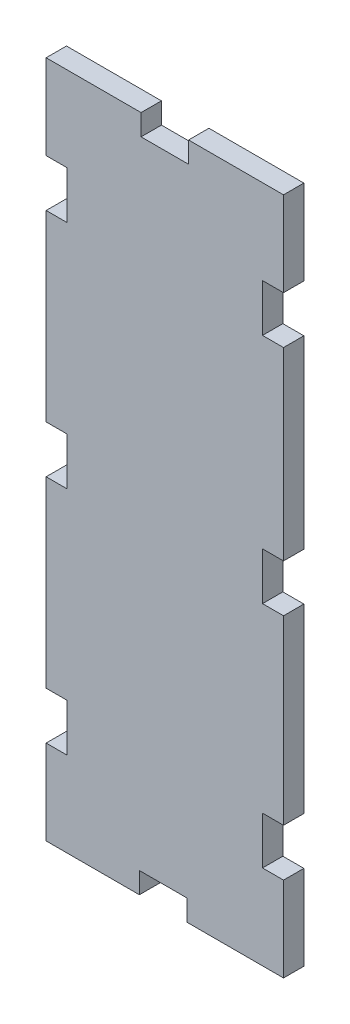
ISO-10303-21;
HEADER;
FILE_DESCRIPTION(('STEP AP214'),'2;1');
FILE_NAME('part.step','',(''),(''),'','','');
FILE_SCHEMA(('AUTOMOTIVE_DESIGN { 1 0 10303 214 1 1 1 1 }'));
ENDSEC;
DATA;
#1=APPLICATION_CONTEXT('core data for automotive mechanical design processes');
#2=APPLICATION_PROTOCOL_DEFINITION('international standard','automotive_design',2000,#1);
#3=PRODUCT_CONTEXT('',#1,'mechanical');
#4=PRODUCT('Part','Part','',(#3));
#5=PRODUCT_RELATED_PRODUCT_CATEGORY('part','',(#4));
#6=PRODUCT_DEFINITION_FORMATION('','',#4);
#7=PRODUCT_DEFINITION_CONTEXT('part definition',#1,'design');
#8=PRODUCT_DEFINITION('design','',#6,#7);
#9=PRODUCT_DEFINITION_SHAPE('','',#8);
#10=(LENGTH_UNIT() NAMED_UNIT(*) SI_UNIT(.MILLI.,.METRE.));
#11=(NAMED_UNIT(*) PLANE_ANGLE_UNIT() SI_UNIT($,.RADIAN.));
#12=(NAMED_UNIT(*) SI_UNIT($,.STERADIAN.) SOLID_ANGLE_UNIT());
#13=UNCERTAINTY_MEASURE_WITH_UNIT(LENGTH_MEASURE(1.E-05),#10,'distance_accuracy_value','');
#14=(GEOMETRIC_REPRESENTATION_CONTEXT(3) GLOBAL_UNCERTAINTY_ASSIGNED_CONTEXT((#13)) GLOBAL_UNIT_ASSIGNED_CONTEXT((#10,
#11,#12)) REPRESENTATION_CONTEXT('',''));
#15=CARTESIAN_POINT('',(0.,0.,0.));
#16=DIRECTION('',(0.,0.,1.));
#17=DIRECTION('',(1.,0.,0.));
#18=AXIS2_PLACEMENT_3D('',#15,#16,#17);
#19=CARTESIAN_POINT('',(0.,0.,6.));
#20=DIRECTION('',(1.,0.,0.));
#21=DIRECTION('',(0.,0.,-1.));
#22=AXIS2_PLACEMENT_3D('',#19,#20,#21);
#23=PLANE('',#22);
#24=DIRECTION('',(0.,-1.,0.));
#25=VECTOR('',#24,1.);
#26=CARTESIAN_POINT('',(0.,0.,6.));
#27=LINE('',#26,#25);
#28=CARTESIAN_POINT('',(0.,25.,6.));
#29=VERTEX_POINT('',#28);
#30=CARTESIAN_POINT('',(0.,0.,6.));
#31=VERTEX_POINT('',#30);
#32=EDGE_CURVE('E490',#29,#31,#27,.T.);
#33=ORIENTED_EDGE('',*,*,#32,.F.);
#34=DIRECTION('',(0.,0.,1.));
#35=VECTOR('',#34,1.);
#36=CARTESIAN_POINT('',(0.,25.,0.));
#37=LINE('',#36,#35);
#38=CARTESIAN_POINT('',(0.,25.,0.));
#39=VERTEX_POINT('',#38);
#40=EDGE_CURVE('E321',#39,#29,#37,.T.);
#41=ORIENTED_EDGE('',*,*,#40,.F.);
#42=DIRECTION('',(0.,-1.,0.));
#43=VECTOR('',#42,1.);
#44=CARTESIAN_POINT('',(0.,0.,0.));
#45=LINE('',#44,#43);
#46=CARTESIAN_POINT('',(0.,0.,0.));
#47=VERTEX_POINT('',#46);
#48=EDGE_CURVE('E301',#39,#47,#45,.T.);
#49=ORIENTED_EDGE('',*,*,#48,.T.);
#50=DIRECTION('',(0.,0.,-1.));
#51=VECTOR('',#50,1.);
#52=CARTESIAN_POINT('',(0.,0.,6.));
#53=LINE('',#52,#51);
#54=EDGE_CURVE('E11',#31,#47,#53,.T.);
#55=ORIENTED_EDGE('',*,*,#54,.F.);
#56=EDGE_LOOP('',(#33,#41,#49,#55));
#57=FACE_BOUND('',#56,.T.);
#58=ADVANCED_FACE('F36',(#57),#23,.F.);
#59=CARTESIAN_POINT('',(0.,93.,0.));
#60=VERTEX_POINT('',#59);
#61=CARTESIAN_POINT('',(0.,39.,0.));
#62=VERTEX_POINT('',#61);
#63=EDGE_CURVE('E591',#60,#62,#45,.T.);
#64=ORIENTED_EDGE('',*,*,#63,.T.);
#65=DIRECTION('',(0.,0.,1.));
#66=VECTOR('',#65,1.);
#67=CARTESIAN_POINT('',(0.,39.,0.));
#68=LINE('',#67,#66);
#69=CARTESIAN_POINT('',(0.,39.,6.));
#70=VERTEX_POINT('',#69);
#71=EDGE_CURVE('E352',#62,#70,#68,.T.);
#72=ORIENTED_EDGE('',*,*,#71,.T.);
#73=CARTESIAN_POINT('',(0.,93.,6.));
#74=VERTEX_POINT('',#73);
#75=EDGE_CURVE('E563',#74,#70,#27,.T.);
#76=ORIENTED_EDGE('',*,*,#75,.F.);
#77=DIRECTION('',(0.,0.,1.));
#78=VECTOR('',#77,1.);
#79=CARTESIAN_POINT('',(0.,93.,0.));
#80=LINE('',#79,#78);
#81=EDGE_CURVE('E325',#60,#74,#80,.T.);
#82=ORIENTED_EDGE('',*,*,#81,.F.);
#83=EDGE_LOOP('',(#64,#72,#76,#82));
#84=FACE_BOUND('',#83,.T.);
#85=ADVANCED_FACE('F590',(#84),#23,.F.);
#86=CARTESIAN_POINT('',(0.,161.,0.));
#87=VERTEX_POINT('',#86);
#88=CARTESIAN_POINT('',(0.,107.,0.));
#89=VERTEX_POINT('',#88);
#90=EDGE_CURVE('E508',#87,#89,#45,.T.);
#91=ORIENTED_EDGE('',*,*,#90,.T.);
#92=DIRECTION('',(0.,0.,1.));
#93=VECTOR('',#92,1.);
#94=CARTESIAN_POINT('',(0.,107.,0.));
#95=LINE('',#94,#93);
#96=CARTESIAN_POINT('',(0.,107.,6.));
#97=VERTEX_POINT('',#96);
#98=EDGE_CURVE('E328',#89,#97,#95,.T.);
#99=ORIENTED_EDGE('',*,*,#98,.T.);
#100=CARTESIAN_POINT('',(0.,161.,6.));
#101=VERTEX_POINT('',#100);
#102=EDGE_CURVE('E489',#101,#97,#27,.T.);
#103=ORIENTED_EDGE('',*,*,#102,.F.);
#104=DIRECTION('',(0.,0.,1.));
#105=VECTOR('',#104,1.);
#106=CARTESIAN_POINT('',(0.,161.,0.));
#107=LINE('',#106,#105);
#108=EDGE_CURVE('E372',#87,#101,#107,.T.);
#109=ORIENTED_EDGE('',*,*,#108,.F.);
#110=EDGE_LOOP('',(#91,#99,#103,#109));
#111=FACE_BOUND('',#110,.T.);
#112=ADVANCED_FACE('F577',(#111),#23,.F.);
#113=CARTESIAN_POINT('',(0.,0.,6.));
#114=DIRECTION('',(0.,1.,0.));
#115=DIRECTION('',(0.,0.,1.));
#116=AXIS2_PLACEMENT_3D('',#113,#114,#115);
#117=PLANE('',#116);
#118=DIRECTION('',(1.,0.,0.));
#119=VECTOR('',#118,1.);
#120=CARTESIAN_POINT('',(0.,0.,0.));
#121=LINE('',#120,#119);
#122=CARTESIAN_POINT('',(27.5,0.,0.));
#123=VERTEX_POINT('',#122);
#124=EDGE_CURVE('E509',#47,#123,#121,.T.);
#125=ORIENTED_EDGE('',*,*,#124,.T.);
#126=DIRECTION('',(0.,0.,1.));
#127=VECTOR('',#126,1.);
#128=CARTESIAN_POINT('',(27.5,0.,0.));
#129=LINE('',#128,#127);
#130=CARTESIAN_POINT('',(27.5,0.,6.));
#131=VERTEX_POINT('',#130);
#132=EDGE_CURVE('E368',#123,#131,#129,.T.);
#133=ORIENTED_EDGE('',*,*,#132,.T.);
#134=DIRECTION('',(1.,0.,0.));
#135=VECTOR('',#134,1.);
#136=CARTESIAN_POINT('',(0.,0.,6.));
#137=LINE('',#136,#135);
#138=EDGE_CURVE('E491',#31,#131,#137,.T.);
#139=ORIENTED_EDGE('',*,*,#138,.F.);
#140=ORIENTED_EDGE('',*,*,#54,.T.);
#141=EDGE_LOOP('',(#125,#133,#139,#140));
#142=FACE_BOUND('',#141,.T.);
#143=ADVANCED_FACE('F556',(#142),#117,.F.);
#144=CARTESIAN_POINT('',(70.,0.,6.));
#145=DIRECTION('',(-1.,0.,0.));
#146=DIRECTION('',(0.,0.,1.));
#147=AXIS2_PLACEMENT_3D('',#144,#145,#146);
#148=PLANE('',#147);
#149=DIRECTION('',(0.,1.,0.));
#150=VECTOR('',#149,1.);
#151=CARTESIAN_POINT('',(70.,0.,0.));
#152=LINE('',#151,#150);
#153=CARTESIAN_POINT('',(70.,106.5,0.));
#154=VERTEX_POINT('',#153);
#155=CARTESIAN_POINT('',(69.9999999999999,161.,0.));
#156=VERTEX_POINT('',#155);
#157=EDGE_CURVE('E717',#154,#156,#152,.T.);
#158=ORIENTED_EDGE('',*,*,#157,.T.);
#159=DIRECTION('',(0.,0.,1.));
#160=VECTOR('',#159,1.);
#161=CARTESIAN_POINT('',(69.9999999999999,161.,0.));
#162=LINE('',#161,#160);
#163=CARTESIAN_POINT('',(69.9999999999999,161.,6.));
#164=VERTEX_POINT('',#163);
#165=EDGE_CURVE('E418',#156,#164,#162,.T.);
#166=ORIENTED_EDGE('',*,*,#165,.T.);
#167=DIRECTION('',(0.,1.,0.));
#168=VECTOR('',#167,1.);
#169=CARTESIAN_POINT('',(70.,0.,6.));
#170=LINE('',#169,#168);
#171=CARTESIAN_POINT('',(70.,106.5,6.));
#172=VERTEX_POINT('',#171);
#173=EDGE_CURVE('E715',#172,#164,#170,.T.);
#174=ORIENTED_EDGE('',*,*,#173,.F.);
#175=DIRECTION('',(0.,0.,1.));
#176=VECTOR('',#175,1.);
#177=CARTESIAN_POINT('',(70.,106.5,0.));
#178=LINE('',#177,#176);
#179=EDGE_CURVE('E456',#154,#172,#178,.T.);
#180=ORIENTED_EDGE('',*,*,#179,.F.);
#181=EDGE_LOOP('',(#158,#166,#174,#180));
#182=FACE_BOUND('',#181,.T.);
#183=ADVANCED_FACE('F618',(#182),#148,.F.);
#184=CARTESIAN_POINT('',(69.9999999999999,39.,0.));
#185=VERTEX_POINT('',#184);
#186=CARTESIAN_POINT('',(70.,92.5,0.));
#187=VERTEX_POINT('',#186);
#188=EDGE_CURVE('E516',#185,#187,#152,.T.);
#189=ORIENTED_EDGE('',*,*,#188,.T.);
#190=DIRECTION('',(0.,0.,1.));
#191=VECTOR('',#190,1.);
#192=CARTESIAN_POINT('',(70.,92.5,0.));
#193=LINE('',#192,#191);
#194=CARTESIAN_POINT('',(70.,92.5,6.));
#195=VERTEX_POINT('',#194);
#196=EDGE_CURVE('E444',#187,#195,#193,.T.);
#197=ORIENTED_EDGE('',*,*,#196,.T.);
#198=CARTESIAN_POINT('',(69.9999999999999,39.,6.));
#199=VERTEX_POINT('',#198);
#200=EDGE_CURVE('E499',#199,#195,#170,.T.);
#201=ORIENTED_EDGE('',*,*,#200,.F.);
#202=DIRECTION('',(0.,0.,1.));
#203=VECTOR('',#202,1.);
#204=CARTESIAN_POINT('',(69.9999999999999,39.,0.));
#205=LINE('',#204,#203);
#206=EDGE_CURVE('E481',#185,#199,#205,.T.);
#207=ORIENTED_EDGE('',*,*,#206,.F.);
#208=EDGE_LOOP('',(#189,#197,#201,#207));
#209=FACE_BOUND('',#208,.T.);
#210=ADVANCED_FACE('F622',(#209),#148,.F.);
#211=CARTESIAN_POINT('',(70.,0.,0.));
#212=VERTEX_POINT('',#211);
#213=CARTESIAN_POINT('',(70.,25.,0.));
#214=VERTEX_POINT('',#213);
#215=EDGE_CURVE('E513',#212,#214,#152,.T.);
#216=ORIENTED_EDGE('',*,*,#215,.T.);
#217=DIRECTION('',(0.,0.,1.));
#218=VECTOR('',#217,1.);
#219=CARTESIAN_POINT('',(70.,25.,0.));
#220=LINE('',#219,#218);
#221=CARTESIAN_POINT('',(70.,25.,6.));
#222=VERTEX_POINT('',#221);
#223=EDGE_CURVE('E470',#214,#222,#220,.T.);
#224=ORIENTED_EDGE('',*,*,#223,.T.);
#225=CARTESIAN_POINT('',(70.,0.,6.));
#226=VERTEX_POINT('',#225);
#227=EDGE_CURVE('E495',#226,#222,#170,.T.);
#228=ORIENTED_EDGE('',*,*,#227,.F.);
#229=DIRECTION('',(0.,0.,-1.));
#230=VECTOR('',#229,1.);
#231=CARTESIAN_POINT('',(70.,0.,6.));
#232=LINE('',#231,#230);
#233=EDGE_CURVE('E44',#226,#212,#232,.T.);
#234=ORIENTED_EDGE('',*,*,#233,.T.);
#235=EDGE_LOOP('',(#216,#224,#228,#234));
#236=FACE_BOUND('',#235,.T.);
#237=ADVANCED_FACE('F529',(#236),#148,.F.);
#238=CARTESIAN_POINT('',(0.,200.,6.));
#239=DIRECTION('',(0.,-1.,0.));
#240=DIRECTION('',(0.,0.,-1.));
#241=AXIS2_PLACEMENT_3D('',#238,#239,#240);
#242=PLANE('',#241);
#243=DIRECTION('',(-1.,0.,0.));
#244=VECTOR('',#243,1.);
#245=CARTESIAN_POINT('',(0.,200.,6.));
#246=LINE('',#245,#244);
#247=CARTESIAN_POINT('',(28.,200.,6.));
#248=VERTEX_POINT('',#247);
#249=CARTESIAN_POINT('',(0.,200.,6.));
#250=VERTEX_POINT('',#249);
#251=EDGE_CURVE('E498',#248,#250,#246,.T.);
#252=ORIENTED_EDGE('',*,*,#251,.F.);
#253=DIRECTION('',(0.,0.,1.));
#254=VECTOR('',#253,1.);
#255=CARTESIAN_POINT('',(28.,200.,0.));
#256=LINE('',#255,#254);
#257=CARTESIAN_POINT('',(28.,200.,0.));
#258=VERTEX_POINT('',#257);
#259=EDGE_CURVE('E299',#258,#248,#256,.T.);
#260=ORIENTED_EDGE('',*,*,#259,.F.);
#261=DIRECTION('',(-1.,0.,0.));
#262=VECTOR('',#261,1.);
#263=CARTESIAN_POINT('',(0.,200.,0.));
#264=LINE('',#263,#262);
#265=CARTESIAN_POINT('',(0.,200.,0.));
#266=VERTEX_POINT('',#265);
#267=EDGE_CURVE('E289',#258,#266,#264,.T.);
#268=ORIENTED_EDGE('',*,*,#267,.T.);
#269=DIRECTION('',(0.,0.,-1.));
#270=VECTOR('',#269,1.);
#271=CARTESIAN_POINT('',(0.,200.,6.));
#272=LINE('',#271,#270);
#273=EDGE_CURVE('E503',#250,#266,#272,.T.);
#274=ORIENTED_EDGE('',*,*,#273,.F.);
#275=EDGE_LOOP('',(#252,#260,#268,#274));
#276=FACE_BOUND('',#275,.T.);
#277=ADVANCED_FACE('F604',(#276),#242,.F.);
#278=CARTESIAN_POINT('',(0.,175.,0.));
#279=VERTEX_POINT('',#278);
#280=EDGE_CURVE('E504',#266,#279,#45,.T.);
#281=ORIENTED_EDGE('',*,*,#280,.T.);
#282=DIRECTION('',(0.,0.,1.));
#283=VECTOR('',#282,1.);
#284=CARTESIAN_POINT('',(0.,175.,0.));
#285=LINE('',#284,#283);
#286=CARTESIAN_POINT('',(0.,175.,6.));
#287=VERTEX_POINT('',#286);
#288=EDGE_CURVE('E402',#279,#287,#285,.T.);
#289=ORIENTED_EDGE('',*,*,#288,.T.);
#290=EDGE_CURVE('E485',#250,#287,#27,.T.);
#291=ORIENTED_EDGE('',*,*,#290,.F.);
#292=ORIENTED_EDGE('',*,*,#273,.T.);
#293=EDGE_LOOP('',(#281,#289,#291,#292));
#294=FACE_BOUND('',#293,.T.);
#295=ADVANCED_FACE('F38',(#294),#23,.F.);
#296=CARTESIAN_POINT('',(41.5,0.,6.));
#297=VERTEX_POINT('',#296);
#298=EDGE_CURVE('E488',#297,#226,#137,.T.);
#299=ORIENTED_EDGE('',*,*,#298,.F.);
#300=DIRECTION('',(0.,0.,1.));
#301=VECTOR('',#300,1.);
#302=CARTESIAN_POINT('',(41.5,0.,0.));
#303=LINE('',#302,#301);
#304=CARTESIAN_POINT('',(41.5,0.,0.));
#305=VERTEX_POINT('',#304);
#306=EDGE_CURVE('E380',#305,#297,#303,.T.);
#307=ORIENTED_EDGE('',*,*,#306,.F.);
#308=EDGE_CURVE('E507',#305,#212,#121,.T.);
#309=ORIENTED_EDGE('',*,*,#308,.T.);
#310=ORIENTED_EDGE('',*,*,#233,.F.);
#311=EDGE_LOOP('',(#299,#307,#309,#310));
#312=FACE_BOUND('',#311,.T.);
#313=ADVANCED_FACE('F543',(#312),#117,.F.);
#314=CARTESIAN_POINT('',(69.9999999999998,175.,6.));
#315=VERTEX_POINT('',#314);
#316=CARTESIAN_POINT('',(70.,200.,6.));
#317=VERTEX_POINT('',#316);
#318=EDGE_CURVE('E494',#315,#317,#170,.T.);
#319=ORIENTED_EDGE('',*,*,#318,.F.);
#320=DIRECTION('',(0.,0.,1.));
#321=VECTOR('',#320,1.);
#322=CARTESIAN_POINT('',(69.9999999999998,175.,0.));
#323=LINE('',#322,#321);
#324=CARTESIAN_POINT('',(69.9999999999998,175.,0.));
#325=VERTEX_POINT('',#324);
#326=EDGE_CURVE('E430',#325,#315,#323,.T.);
#327=ORIENTED_EDGE('',*,*,#326,.F.);
#328=CARTESIAN_POINT('',(70.,200.,0.));
#329=VERTEX_POINT('',#328);
#330=EDGE_CURVE('E512',#325,#329,#152,.T.);
#331=ORIENTED_EDGE('',*,*,#330,.T.);
#332=DIRECTION('',(0.,0.,-1.));
#333=VECTOR('',#332,1.);
#334=CARTESIAN_POINT('',(70.,200.,6.));
#335=LINE('',#334,#333);
#336=EDGE_CURVE('E522',#317,#329,#335,.T.);
#337=ORIENTED_EDGE('',*,*,#336,.F.);
#338=EDGE_LOOP('',(#319,#327,#331,#337));
#339=FACE_BOUND('',#338,.T.);
#340=ADVANCED_FACE('F610',(#339),#148,.F.);
#341=CARTESIAN_POINT('',(42.,200.,0.));
#342=VERTEX_POINT('',#341);
#343=EDGE_CURVE('E517',#329,#342,#264,.T.);
#344=ORIENTED_EDGE('',*,*,#343,.T.);
#345=DIRECTION('',(0.,0.,1.));
#346=VECTOR('',#345,1.);
#347=CARTESIAN_POINT('',(42.,200.,0.));
#348=LINE('',#347,#346);
#349=CARTESIAN_POINT('',(42.,200.,6.));
#350=VERTEX_POINT('',#349);
#351=EDGE_CURVE('E302',#342,#350,#348,.T.);
#352=ORIENTED_EDGE('',*,*,#351,.T.);
#353=EDGE_CURVE('E500',#317,#350,#246,.T.);
#354=ORIENTED_EDGE('',*,*,#353,.F.);
#355=ORIENTED_EDGE('',*,*,#336,.T.);
#356=EDGE_LOOP('',(#344,#352,#354,#355));
#357=FACE_BOUND('',#356,.T.);
#358=ADVANCED_FACE('F613',(#357),#242,.F.);
#359=CARTESIAN_POINT('',(0.,0.,6.));
#360=DIRECTION('',(0.,0.,-1.));
#361=DIRECTION('',(-1.,0.,0.));
#362=AXIS2_PLACEMENT_3D('',#359,#360,#361);
#363=PLANE('',#362);
#364=DIRECTION('',(1.,0.,0.));
#365=VECTOR('',#364,1.);
#366=CARTESIAN_POINT('',(28.,193.8,6.));
#367=LINE('',#366,#365);
#368=CARTESIAN_POINT('',(28.,193.8,6.));
#369=VERTEX_POINT('',#368);
#370=CARTESIAN_POINT('',(42.,193.8,6.));
#371=VERTEX_POINT('',#370);
#372=EDGE_CURVE('E292',#369,#371,#367,.T.);
#373=ORIENTED_EDGE('',*,*,#372,.F.);
#374=DIRECTION('',(0.,-1.,0.));
#375=VECTOR('',#374,1.);
#376=CARTESIAN_POINT('',(28.,200.,6.));
#377=LINE('',#376,#375);
#378=EDGE_CURVE('E275',#248,#369,#377,.T.);
#379=ORIENTED_EDGE('',*,*,#378,.F.);
#380=ORIENTED_EDGE('',*,*,#251,.T.);
#381=ORIENTED_EDGE('',*,*,#290,.T.);
#382=DIRECTION('',(-1.,0.,0.));
#383=VECTOR('',#382,1.);
#384=CARTESIAN_POINT('',(6.2,175.,6.));
#385=LINE('',#384,#383);
#386=CARTESIAN_POINT('',(6.2,175.,6.));
#387=VERTEX_POINT('',#386);
#388=EDGE_CURVE('E388',#387,#287,#385,.T.);
#389=ORIENTED_EDGE('',*,*,#388,.F.);
#390=DIRECTION('',(0.,1.,0.));
#391=VECTOR('',#390,1.);
#392=CARTESIAN_POINT('',(6.20000000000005,161.,6.));
#393=LINE('',#392,#391);
#394=CARTESIAN_POINT('',(6.20000000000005,161.,6.));
#395=VERTEX_POINT('',#394);
#396=EDGE_CURVE('E397',#395,#387,#393,.T.);
#397=ORIENTED_EDGE('',*,*,#396,.F.);
#398=DIRECTION('',(1.,0.,0.));
#399=VECTOR('',#398,1.);
#400=CARTESIAN_POINT('',(0.,161.,6.));
#401=LINE('',#400,#399);
#402=EDGE_CURVE('E327',#101,#395,#401,.T.);
#403=ORIENTED_EDGE('',*,*,#402,.F.);
#404=ORIENTED_EDGE('',*,*,#102,.T.);
#405=DIRECTION('',(-1.,0.,0.));
#406=VECTOR('',#405,1.);
#407=CARTESIAN_POINT('',(6.2,107.,6.));
#408=LINE('',#407,#406);
#409=CARTESIAN_POINT('',(6.2,107.,6.));
#410=VERTEX_POINT('',#409);
#411=EDGE_CURVE('E310',#410,#97,#408,.T.);
#412=ORIENTED_EDGE('',*,*,#411,.F.);
#413=DIRECTION('',(0.,1.,0.));
#414=VECTOR('',#413,1.);
#415=CARTESIAN_POINT('',(6.20000000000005,93.,6.));
#416=LINE('',#415,#414);
#417=CARTESIAN_POINT('',(6.20000000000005,93.,6.));
#418=VERTEX_POINT('',#417);
#419=EDGE_CURVE('E320',#418,#410,#416,.T.);
#420=ORIENTED_EDGE('',*,*,#419,.F.);
#421=DIRECTION('',(1.,0.,0.));
#422=VECTOR('',#421,1.);
#423=CARTESIAN_POINT('',(0.,93.,6.));
#424=LINE('',#423,#422);
#425=EDGE_CURVE('E317',#74,#418,#424,.T.);
#426=ORIENTED_EDGE('',*,*,#425,.F.);
#427=ORIENTED_EDGE('',*,*,#75,.T.);
#428=DIRECTION('',(-1.,0.,0.));
#429=VECTOR('',#428,1.);
#430=CARTESIAN_POINT('',(6.2,39.,6.));
#431=LINE('',#430,#429);
#432=CARTESIAN_POINT('',(6.2,39.,6.));
#433=VERTEX_POINT('',#432);
#434=EDGE_CURVE('E338',#433,#70,#431,.T.);
#435=ORIENTED_EDGE('',*,*,#434,.F.);
#436=DIRECTION('',(0.,1.,0.));
#437=VECTOR('',#436,1.);
#438=CARTESIAN_POINT('',(6.20000000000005,25.,6.));
#439=LINE('',#438,#437);
#440=CARTESIAN_POINT('',(6.20000000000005,25.,6.));
#441=VERTEX_POINT('',#440);
#442=EDGE_CURVE('E346',#441,#433,#439,.T.);
#443=ORIENTED_EDGE('',*,*,#442,.F.);
#444=DIRECTION('',(1.,0.,0.));
#445=VECTOR('',#444,1.);
#446=CARTESIAN_POINT('',(0.,25.,6.));
#447=LINE('',#446,#445);
#448=EDGE_CURVE('E343',#29,#441,#447,.T.);
#449=ORIENTED_EDGE('',*,*,#448,.F.);
#450=ORIENTED_EDGE('',*,*,#32,.T.);
#451=ORIENTED_EDGE('',*,*,#138,.T.);
#452=DIRECTION('',(0.,-1.,0.));
#453=VECTOR('',#452,1.);
#454=CARTESIAN_POINT('',(27.5,6.2,6.));
#455=LINE('',#454,#453);
#456=CARTESIAN_POINT('',(27.5,6.2,6.));
#457=VERTEX_POINT('',#456);
#458=EDGE_CURVE('E369',#457,#131,#455,.T.);
#459=ORIENTED_EDGE('',*,*,#458,.F.);
#460=DIRECTION('',(-1.,0.,0.));
#461=VECTOR('',#460,1.);
#462=CARTESIAN_POINT('',(41.5,6.2,6.));
#463=LINE('',#462,#461);
#464=CARTESIAN_POINT('',(41.5,6.2,6.));
#465=VERTEX_POINT('',#464);
#466=EDGE_CURVE('E362',#465,#457,#463,.T.);
#467=ORIENTED_EDGE('',*,*,#466,.F.);
#468=DIRECTION('',(0.,1.,0.));
#469=VECTOR('',#468,1.);
#470=CARTESIAN_POINT('',(41.5,0.,6.));
#471=LINE('',#470,#469);
#472=EDGE_CURVE('E371',#297,#465,#471,.T.);
#473=ORIENTED_EDGE('',*,*,#472,.F.);
#474=ORIENTED_EDGE('',*,*,#298,.T.);
#475=ORIENTED_EDGE('',*,*,#227,.T.);
#476=DIRECTION('',(1.,0.,0.));
#477=VECTOR('',#476,1.);
#478=CARTESIAN_POINT('',(63.8,25.,6.));
#479=LINE('',#478,#477);
#480=CARTESIAN_POINT('',(63.8,25.,6.));
#481=VERTEX_POINT('',#480);
#482=EDGE_CURVE('E471',#481,#222,#479,.T.);
#483=ORIENTED_EDGE('',*,*,#482,.F.);
#484=DIRECTION('',(0.,-1.,0.));
#485=VECTOR('',#484,1.);
#486=CARTESIAN_POINT('',(63.7999999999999,39.,6.));
#487=LINE('',#486,#485);
#488=CARTESIAN_POINT('',(63.7999999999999,39.,6.));
#489=VERTEX_POINT('',#488);
#490=EDGE_CURVE('E464',#489,#481,#487,.T.);
#491=ORIENTED_EDGE('',*,*,#490,.F.);
#492=DIRECTION('',(-1.,0.,0.));
#493=VECTOR('',#492,1.);
#494=CARTESIAN_POINT('',(69.9999999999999,39.,6.));
#495=LINE('',#494,#493);
#496=EDGE_CURVE('E473',#199,#489,#495,.T.);
#497=ORIENTED_EDGE('',*,*,#496,.F.);
#498=ORIENTED_EDGE('',*,*,#200,.T.);
#499=DIRECTION('',(1.,0.,0.));
#500=VECTOR('',#499,1.);
#501=CARTESIAN_POINT('',(63.8,92.5,6.));
#502=LINE('',#501,#500);
#503=CARTESIAN_POINT('',(63.8,92.5,6.));
#504=VERTEX_POINT('',#503);
#505=EDGE_CURVE('E445',#504,#195,#502,.T.);
#506=ORIENTED_EDGE('',*,*,#505,.F.);
#507=DIRECTION('',(0.,-1.,0.));
#508=VECTOR('',#507,1.);
#509=CARTESIAN_POINT('',(63.8,106.5,6.));
#510=LINE('',#509,#508);
#511=CARTESIAN_POINT('',(63.8,106.5,6.));
#512=VERTEX_POINT('',#511);
#513=EDGE_CURVE('E438',#512,#504,#510,.T.);
#514=ORIENTED_EDGE('',*,*,#513,.F.);
#515=DIRECTION('',(-1.,0.,0.));
#516=VECTOR('',#515,1.);
#517=CARTESIAN_POINT('',(70.,106.5,6.));
#518=LINE('',#517,#516);
#519=EDGE_CURVE('E447',#172,#512,#518,.T.);
#520=ORIENTED_EDGE('',*,*,#519,.F.);
#521=ORIENTED_EDGE('',*,*,#173,.T.);
#522=DIRECTION('',(1.,0.,0.));
#523=VECTOR('',#522,1.);
#524=CARTESIAN_POINT('',(63.7999999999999,161.,6.));
#525=LINE('',#524,#523);
#526=CARTESIAN_POINT('',(63.7999999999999,161.,6.));
#527=VERTEX_POINT('',#526);
#528=EDGE_CURVE('E419',#527,#164,#525,.T.);
#529=ORIENTED_EDGE('',*,*,#528,.F.);
#530=DIRECTION('',(0.,-1.,0.));
#531=VECTOR('',#530,1.);
#532=CARTESIAN_POINT('',(63.7999999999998,175.,6.));
#533=LINE('',#532,#531);
#534=CARTESIAN_POINT('',(63.7999999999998,175.,6.));
#535=VERTEX_POINT('',#534);
#536=EDGE_CURVE('E412',#535,#527,#533,.T.);
#537=ORIENTED_EDGE('',*,*,#536,.F.);
#538=DIRECTION('',(-1.,0.,0.));
#539=VECTOR('',#538,1.);
#540=CARTESIAN_POINT('',(69.9999999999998,175.,6.));
#541=LINE('',#540,#539);
#542=EDGE_CURVE('E421',#315,#535,#541,.T.);
#543=ORIENTED_EDGE('',*,*,#542,.F.);
#544=ORIENTED_EDGE('',*,*,#318,.T.);
#545=ORIENTED_EDGE('',*,*,#353,.T.);
#546=DIRECTION('',(0.,1.,0.));
#547=VECTOR('',#546,1.);
#548=CARTESIAN_POINT('',(42.,193.8,6.));
#549=LINE('',#548,#547);
#550=EDGE_CURVE('E290',#371,#350,#549,.T.);
#551=ORIENTED_EDGE('',*,*,#550,.F.);
#552=EDGE_LOOP('',(#373,#379,#380,#381,#389,#397,#403,#404,#412,#420,#426,#427,#435,#443,#449,
#450,#451,#459,#467,#473,#474,#475,#483,#491,#497,#498,#506,#514,#520,#521,#529,#537,#543,#544,
#545,#551));
#553=FACE_BOUND('',#552,.T.);
#554=ADVANCED_FACE('F538',(#553),#363,.F.);
#555=CARTESIAN_POINT('',(0.,0.,0.));
#556=DIRECTION('',(0.,0.,-1.));
#557=DIRECTION('',(-1.,0.,0.));
#558=AXIS2_PLACEMENT_3D('',#555,#556,#557);
#559=PLANE('',#558);
#560=DIRECTION('',(0.,-1.,0.));
#561=VECTOR('',#560,1.);
#562=CARTESIAN_POINT('',(28.,200.,0.));
#563=LINE('',#562,#561);
#564=CARTESIAN_POINT('',(28.,193.8,0.));
#565=VERTEX_POINT('',#564);
#566=EDGE_CURVE('E272',#258,#565,#563,.T.);
#567=ORIENTED_EDGE('',*,*,#566,.T.);
#568=DIRECTION('',(1.,0.,0.));
#569=VECTOR('',#568,1.);
#570=CARTESIAN_POINT('',(28.,193.8,0.));
#571=LINE('',#570,#569);
#572=CARTESIAN_POINT('',(42.,193.8,0.));
#573=VERTEX_POINT('',#572);
#574=EDGE_CURVE('E282',#565,#573,#571,.T.);
#575=ORIENTED_EDGE('',*,*,#574,.T.);
#576=DIRECTION('',(0.,1.,0.));
#577=VECTOR('',#576,1.);
#578=CARTESIAN_POINT('',(42.,193.8,0.));
#579=LINE('',#578,#577);
#580=EDGE_CURVE('E51',#573,#342,#579,.T.);
#581=ORIENTED_EDGE('',*,*,#580,.T.);
#582=ORIENTED_EDGE('',*,*,#343,.F.);
#583=ORIENTED_EDGE('',*,*,#330,.F.);
#584=DIRECTION('',(-1.,0.,0.));
#585=VECTOR('',#584,1.);
#586=CARTESIAN_POINT('',(69.9999999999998,175.,0.));
#587=LINE('',#586,#585);
#588=CARTESIAN_POINT('',(63.7999999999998,175.,0.));
#589=VERTEX_POINT('',#588);
#590=EDGE_CURVE('E411',#325,#589,#587,.T.);
#591=ORIENTED_EDGE('',*,*,#590,.T.);
#592=DIRECTION('',(0.,-1.,0.));
#593=VECTOR('',#592,1.);
#594=CARTESIAN_POINT('',(63.7999999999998,175.,0.));
#595=LINE('',#594,#593);
#596=CARTESIAN_POINT('',(63.7999999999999,161.,0.));
#597=VERTEX_POINT('',#596);
#598=EDGE_CURVE('E415',#589,#597,#595,.T.);
#599=ORIENTED_EDGE('',*,*,#598,.T.);
#600=DIRECTION('',(1.,0.,0.));
#601=VECTOR('',#600,1.);
#602=CARTESIAN_POINT('',(63.7999999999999,161.,0.));
#603=LINE('',#602,#601);
#604=EDGE_CURVE('E408',#597,#156,#603,.T.);
#605=ORIENTED_EDGE('',*,*,#604,.T.);
#606=ORIENTED_EDGE('',*,*,#157,.F.);
#607=DIRECTION('',(-1.,0.,0.));
#608=VECTOR('',#607,1.);
#609=CARTESIAN_POINT('',(70.,106.5,0.));
#610=LINE('',#609,#608);
#611=CARTESIAN_POINT('',(63.8,106.5,0.));
#612=VERTEX_POINT('',#611);
#613=EDGE_CURVE('E437',#154,#612,#610,.T.);
#614=ORIENTED_EDGE('',*,*,#613,.T.);
#615=DIRECTION('',(0.,-1.,0.));
#616=VECTOR('',#615,1.);
#617=CARTESIAN_POINT('',(63.8,106.5,0.));
#618=LINE('',#617,#616);
#619=CARTESIAN_POINT('',(63.8,92.5,0.));
#620=VERTEX_POINT('',#619);
#621=EDGE_CURVE('E441',#612,#620,#618,.T.);
#622=ORIENTED_EDGE('',*,*,#621,.T.);
#623=DIRECTION('',(1.,0.,0.));
#624=VECTOR('',#623,1.);
#625=CARTESIAN_POINT('',(63.8,92.5,0.));
#626=LINE('',#625,#624);
#627=EDGE_CURVE('E434',#620,#187,#626,.T.);
#628=ORIENTED_EDGE('',*,*,#627,.T.);
#629=ORIENTED_EDGE('',*,*,#188,.F.);
#630=DIRECTION('',(-1.,0.,0.));
#631=VECTOR('',#630,1.);
#632=CARTESIAN_POINT('',(69.9999999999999,39.,0.));
#633=LINE('',#632,#631);
#634=CARTESIAN_POINT('',(63.7999999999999,39.,0.));
#635=VERTEX_POINT('',#634);
#636=EDGE_CURVE('E463',#185,#635,#633,.T.);
#637=ORIENTED_EDGE('',*,*,#636,.T.);
#638=DIRECTION('',(0.,-1.,0.));
#639=VECTOR('',#638,1.);
#640=CARTESIAN_POINT('',(63.7999999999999,39.,0.));
#641=LINE('',#640,#639);
#642=CARTESIAN_POINT('',(63.8,25.,0.));
#643=VERTEX_POINT('',#642);
#644=EDGE_CURVE('E467',#635,#643,#641,.T.);
#645=ORIENTED_EDGE('',*,*,#644,.T.);
#646=DIRECTION('',(1.,0.,0.));
#647=VECTOR('',#646,1.);
#648=CARTESIAN_POINT('',(63.8,25.,0.));
#649=LINE('',#648,#647);
#650=EDGE_CURVE('E460',#643,#214,#649,.T.);
#651=ORIENTED_EDGE('',*,*,#650,.T.);
#652=ORIENTED_EDGE('',*,*,#215,.F.);
#653=ORIENTED_EDGE('',*,*,#308,.F.);
#654=DIRECTION('',(0.,1.,0.));
#655=VECTOR('',#654,1.);
#656=CARTESIAN_POINT('',(41.5,0.,0.));
#657=LINE('',#656,#655);
#658=CARTESIAN_POINT('',(41.5,6.2,0.));
#659=VERTEX_POINT('',#658);
#660=EDGE_CURVE('E361',#305,#659,#657,.T.);
#661=ORIENTED_EDGE('',*,*,#660,.T.);
#662=DIRECTION('',(-1.,0.,0.));
#663=VECTOR('',#662,1.);
#664=CARTESIAN_POINT('',(41.5,6.2,0.));
#665=LINE('',#664,#663);
#666=CARTESIAN_POINT('',(27.5,6.2,0.));
#667=VERTEX_POINT('',#666);
#668=EDGE_CURVE('E365',#659,#667,#665,.T.);
#669=ORIENTED_EDGE('',*,*,#668,.T.);
#670=DIRECTION('',(0.,-1.,0.));
#671=VECTOR('',#670,1.);
#672=CARTESIAN_POINT('',(27.5,6.2,0.));
#673=LINE('',#672,#671);
#674=EDGE_CURVE('E358',#667,#123,#673,.T.);
#675=ORIENTED_EDGE('',*,*,#674,.T.);
#676=ORIENTED_EDGE('',*,*,#124,.F.);
#677=ORIENTED_EDGE('',*,*,#48,.F.);
#678=DIRECTION('',(1.,0.,0.));
#679=VECTOR('',#678,1.);
#680=CARTESIAN_POINT('',(0.,25.,0.));
#681=LINE('',#680,#679);
#682=CARTESIAN_POINT('',(6.20000000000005,25.,0.));
#683=VERTEX_POINT('',#682);
#684=EDGE_CURVE('E334',#39,#683,#681,.T.);
#685=ORIENTED_EDGE('',*,*,#684,.T.);
#686=DIRECTION('',(0.,1.,0.));
#687=VECTOR('',#686,1.);
#688=CARTESIAN_POINT('',(6.20000000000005,25.,0.));
#689=LINE('',#688,#687);
#690=CARTESIAN_POINT('',(6.2,39.,0.));
#691=VERTEX_POINT('',#690);
#692=EDGE_CURVE('E337',#683,#691,#689,.T.);
#693=ORIENTED_EDGE('',*,*,#692,.T.);
#694=DIRECTION('',(-1.,0.,0.));
#695=VECTOR('',#694,1.);
#696=CARTESIAN_POINT('',(6.2,39.,0.));
#697=LINE('',#696,#695);
#698=EDGE_CURVE('E59',#691,#62,#697,.T.);
#699=ORIENTED_EDGE('',*,*,#698,.T.);
#700=ORIENTED_EDGE('',*,*,#63,.F.);
#701=DIRECTION('',(1.,0.,0.));
#702=VECTOR('',#701,1.);
#703=CARTESIAN_POINT('',(0.,93.,0.));
#704=LINE('',#703,#702);
#705=CARTESIAN_POINT('',(6.20000000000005,93.,0.));
#706=VERTEX_POINT('',#705);
#707=EDGE_CURVE('E306',#60,#706,#704,.T.);
#708=ORIENTED_EDGE('',*,*,#707,.T.);
#709=DIRECTION('',(0.,1.,0.));
#710=VECTOR('',#709,1.);
#711=CARTESIAN_POINT('',(6.20000000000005,93.,0.));
#712=LINE('',#711,#710);
#713=CARTESIAN_POINT('',(6.2,107.,0.));
#714=VERTEX_POINT('',#713);
#715=EDGE_CURVE('E309',#706,#714,#712,.T.);
#716=ORIENTED_EDGE('',*,*,#715,.T.);
#717=DIRECTION('',(-1.,0.,0.));
#718=VECTOR('',#717,1.);
#719=CARTESIAN_POINT('',(6.2,107.,0.));
#720=LINE('',#719,#718);
#721=EDGE_CURVE('E313',#714,#89,#720,.T.);
#722=ORIENTED_EDGE('',*,*,#721,.T.);
#723=ORIENTED_EDGE('',*,*,#90,.F.);
#724=DIRECTION('',(1.,0.,0.));
#725=VECTOR('',#724,1.);
#726=CARTESIAN_POINT('',(0.,161.,0.));
#727=LINE('',#726,#725);
#728=CARTESIAN_POINT('',(6.20000000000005,161.,0.));
#729=VERTEX_POINT('',#728);
#730=EDGE_CURVE('E384',#87,#729,#727,.T.);
#731=ORIENTED_EDGE('',*,*,#730,.T.);
#732=DIRECTION('',(0.,1.,0.));
#733=VECTOR('',#732,1.);
#734=CARTESIAN_POINT('',(6.20000000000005,161.,0.));
#735=LINE('',#734,#733);
#736=CARTESIAN_POINT('',(6.2,175.,0.));
#737=VERTEX_POINT('',#736);
#738=EDGE_CURVE('E387',#729,#737,#735,.T.);
#739=ORIENTED_EDGE('',*,*,#738,.T.);
#740=DIRECTION('',(-1.,0.,0.));
#741=VECTOR('',#740,1.);
#742=CARTESIAN_POINT('',(6.2,175.,0.));
#743=LINE('',#742,#741);
#744=EDGE_CURVE('E391',#737,#279,#743,.T.);
#745=ORIENTED_EDGE('',*,*,#744,.T.);
#746=ORIENTED_EDGE('',*,*,#280,.F.);
#747=ORIENTED_EDGE('',*,*,#267,.F.);
#748=EDGE_LOOP('',(#567,#575,#581,#582,#583,#591,#599,#605,#606,#614,#622,#628,#629,#637,#645,
#651,#652,#653,#661,#669,#675,#676,#677,#685,#693,#699,#700,#708,#716,#722,#723,#731,#739,#745,
#746,#747));
#749=FACE_BOUND('',#748,.T.);
#750=ADVANCED_FACE('F287',(#749),#559,.T.);
#751=CARTESIAN_POINT('',(63.8,25.,0.));
#752=DIRECTION('',(0.,-1.,0.));
#753=DIRECTION('',(1.,0.,0.));
#754=AXIS2_PLACEMENT_3D('',#751,#752,#753);
#755=PLANE('',#754);
#756=ORIENTED_EDGE('',*,*,#482,.T.);
#757=ORIENTED_EDGE('',*,*,#223,.F.);
#758=ORIENTED_EDGE('',*,*,#650,.F.);
#759=DIRECTION('',(0.,0.,1.));
#760=VECTOR('',#759,1.);
#761=CARTESIAN_POINT('',(63.8,25.,0.));
#762=LINE('',#761,#760);
#763=EDGE_CURVE('E448',#643,#481,#762,.T.);
#764=ORIENTED_EDGE('',*,*,#763,.T.);
#765=EDGE_LOOP('',(#756,#757,#758,#764));
#766=FACE_BOUND('',#765,.T.);
#767=ADVANCED_FACE('F535',(#766),#755,.F.);
#768=CARTESIAN_POINT('',(63.7999999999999,39.,0.));
#769=DIRECTION('',(-1.,0.,0.));
#770=DIRECTION('',(0.,-1.,0.));
#771=AXIS2_PLACEMENT_3D('',#768,#769,#770);
#772=PLANE('',#771);
#773=ORIENTED_EDGE('',*,*,#490,.T.);
#774=ORIENTED_EDGE('',*,*,#763,.F.);
#775=ORIENTED_EDGE('',*,*,#644,.F.);
#776=DIRECTION('',(0.,0.,1.));
#777=VECTOR('',#776,1.);
#778=CARTESIAN_POINT('',(63.7999999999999,39.,0.));
#779=LINE('',#778,#777);
#780=EDGE_CURVE('E479',#635,#489,#779,.T.);
#781=ORIENTED_EDGE('',*,*,#780,.T.);
#782=EDGE_LOOP('',(#773,#774,#775,#781));
#783=FACE_BOUND('',#782,.T.);
#784=ADVANCED_FACE('F636',(#783),#772,.F.);
#785=CARTESIAN_POINT('',(69.9999999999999,39.,0.));
#786=DIRECTION('',(0.,1.,0.));
#787=DIRECTION('',(-1.,0.,0.));
#788=AXIS2_PLACEMENT_3D('',#785,#786,#787);
#789=PLANE('',#788);
#790=ORIENTED_EDGE('',*,*,#496,.T.);
#791=ORIENTED_EDGE('',*,*,#780,.F.);
#792=ORIENTED_EDGE('',*,*,#636,.F.);
#793=ORIENTED_EDGE('',*,*,#206,.T.);
#794=EDGE_LOOP('',(#790,#791,#792,#793));
#795=FACE_BOUND('',#794,.T.);
#796=ADVANCED_FACE('F637',(#795),#789,.F.);
#797=CARTESIAN_POINT('',(63.8,92.5,0.));
#798=DIRECTION('',(0.,-1.,0.));
#799=DIRECTION('',(1.,0.,0.));
#800=AXIS2_PLACEMENT_3D('',#797,#798,#799);
#801=PLANE('',#800);
#802=ORIENTED_EDGE('',*,*,#505,.T.);
#803=ORIENTED_EDGE('',*,*,#196,.F.);
#804=ORIENTED_EDGE('',*,*,#627,.F.);
#805=DIRECTION('',(0.,0.,1.));
#806=VECTOR('',#805,1.);
#807=CARTESIAN_POINT('',(63.8,92.5,0.));
#808=LINE('',#807,#806);
#809=EDGE_CURVE('E422',#620,#504,#808,.T.);
#810=ORIENTED_EDGE('',*,*,#809,.T.);
#811=EDGE_LOOP('',(#802,#803,#804,#810));
#812=FACE_BOUND('',#811,.T.);
#813=ADVANCED_FACE('F640',(#812),#801,.F.);
#814=CARTESIAN_POINT('',(63.8,106.5,0.));
#815=DIRECTION('',(-1.,0.,0.));
#816=DIRECTION('',(0.,-1.,0.));
#817=AXIS2_PLACEMENT_3D('',#814,#815,#816);
#818=PLANE('',#817);
#819=ORIENTED_EDGE('',*,*,#513,.T.);
#820=ORIENTED_EDGE('',*,*,#809,.F.);
#821=ORIENTED_EDGE('',*,*,#621,.F.);
#822=DIRECTION('',(0.,0.,1.));
#823=VECTOR('',#822,1.);
#824=CARTESIAN_POINT('',(63.8,106.5,0.));
#825=LINE('',#824,#823);
#826=EDGE_CURVE('E454',#612,#512,#825,.T.);
#827=ORIENTED_EDGE('',*,*,#826,.T.);
#828=EDGE_LOOP('',(#819,#820,#821,#827));
#829=FACE_BOUND('',#828,.T.);
#830=ADVANCED_FACE('F647',(#829),#818,.F.);
#831=CARTESIAN_POINT('',(70.,106.5,0.));
#832=DIRECTION('',(0.,1.,0.));
#833=DIRECTION('',(-1.,0.,0.));
#834=AXIS2_PLACEMENT_3D('',#831,#832,#833);
#835=PLANE('',#834);
#836=ORIENTED_EDGE('',*,*,#519,.T.);
#837=ORIENTED_EDGE('',*,*,#826,.F.);
#838=ORIENTED_EDGE('',*,*,#613,.F.);
#839=ORIENTED_EDGE('',*,*,#179,.T.);
#840=EDGE_LOOP('',(#836,#837,#838,#839));
#841=FACE_BOUND('',#840,.T.);
#842=ADVANCED_FACE('F649',(#841),#835,.F.);
#843=CARTESIAN_POINT('',(63.7999999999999,161.,0.));
#844=DIRECTION('',(0.,-1.,0.));
#845=DIRECTION('',(1.,0.,0.));
#846=AXIS2_PLACEMENT_3D('',#843,#844,#845);
#847=PLANE('',#846);
#848=ORIENTED_EDGE('',*,*,#528,.T.);
#849=ORIENTED_EDGE('',*,*,#165,.F.);
#850=ORIENTED_EDGE('',*,*,#604,.F.);
#851=DIRECTION('',(0.,0.,1.));
#852=VECTOR('',#851,1.);
#853=CARTESIAN_POINT('',(63.7999999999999,161.,0.));
#854=LINE('',#853,#852);
#855=EDGE_CURVE('E347',#597,#527,#854,.T.);
#856=ORIENTED_EDGE('',*,*,#855,.T.);
#857=EDGE_LOOP('',(#848,#849,#850,#856));
#858=FACE_BOUND('',#857,.T.);
#859=ADVANCED_FACE('F652',(#858),#847,.F.);
#860=CARTESIAN_POINT('',(63.7999999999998,175.,0.));
#861=DIRECTION('',(-1.,0.,0.));
#862=DIRECTION('',(0.,-1.,0.));
#863=AXIS2_PLACEMENT_3D('',#860,#861,#862);
#864=PLANE('',#863);
#865=ORIENTED_EDGE('',*,*,#536,.T.);
#866=ORIENTED_EDGE('',*,*,#855,.F.);
#867=ORIENTED_EDGE('',*,*,#598,.F.);
#868=DIRECTION('',(0.,0.,1.));
#869=VECTOR('',#868,1.);
#870=CARTESIAN_POINT('',(63.7999999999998,175.,0.));
#871=LINE('',#870,#869);
#872=EDGE_CURVE('E428',#589,#535,#871,.T.);
#873=ORIENTED_EDGE('',*,*,#872,.T.);
#874=EDGE_LOOP('',(#865,#866,#867,#873));
#875=FACE_BOUND('',#874,.T.);
#876=ADVANCED_FACE('F659',(#875),#864,.F.);
#877=CARTESIAN_POINT('',(69.9999999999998,175.,0.));
#878=DIRECTION('',(0.,1.,0.));
#879=DIRECTION('',(-1.,0.,0.));
#880=AXIS2_PLACEMENT_3D('',#877,#878,#879);
#881=PLANE('',#880);
#882=ORIENTED_EDGE('',*,*,#542,.T.);
#883=ORIENTED_EDGE('',*,*,#872,.F.);
#884=ORIENTED_EDGE('',*,*,#590,.F.);
#885=ORIENTED_EDGE('',*,*,#326,.T.);
#886=EDGE_LOOP('',(#882,#883,#884,#885));
#887=FACE_BOUND('',#886,.T.);
#888=ADVANCED_FACE('F661',(#887),#881,.F.);
#889=CARTESIAN_POINT('',(27.5,6.2,0.));
#890=DIRECTION('',(-1.,0.,0.));
#891=DIRECTION('',(0.,0.,1.));
#892=AXIS2_PLACEMENT_3D('',#889,#890,#891);
#893=PLANE('',#892);
#894=ORIENTED_EDGE('',*,*,#458,.T.);
#895=ORIENTED_EDGE('',*,*,#132,.F.);
#896=ORIENTED_EDGE('',*,*,#674,.F.);
#897=DIRECTION('',(0.,0.,1.));
#898=VECTOR('',#897,1.);
#899=CARTESIAN_POINT('',(27.5,6.2,0.));
#900=LINE('',#899,#898);
#901=EDGE_CURVE('E297',#667,#457,#900,.T.);
#902=ORIENTED_EDGE('',*,*,#901,.T.);
#903=EDGE_LOOP('',(#894,#895,#896,#902));
#904=FACE_BOUND('',#903,.T.);
#905=ADVANCED_FACE('F553',(#904),#893,.F.);
#906=CARTESIAN_POINT('',(41.5,6.2,0.));
#907=DIRECTION('',(0.,1.,0.));
#908=DIRECTION('',(0.,0.,1.));
#909=AXIS2_PLACEMENT_3D('',#906,#907,#908);
#910=PLANE('',#909);
#911=ORIENTED_EDGE('',*,*,#466,.T.);
#912=ORIENTED_EDGE('',*,*,#901,.F.);
#913=ORIENTED_EDGE('',*,*,#668,.F.);
#914=DIRECTION('',(0.,0.,1.));
#915=VECTOR('',#914,1.);
#916=CARTESIAN_POINT('',(41.5,6.2,0.));
#917=LINE('',#916,#915);
#918=EDGE_CURVE('E378',#659,#465,#917,.T.);
#919=ORIENTED_EDGE('',*,*,#918,.T.);
#920=EDGE_LOOP('',(#911,#912,#913,#919));
#921=FACE_BOUND('',#920,.T.);
#922=ADVANCED_FACE('F550',(#921),#910,.F.);
#923=CARTESIAN_POINT('',(41.5,0.,0.));
#924=DIRECTION('',(1.,0.,0.));
#925=DIRECTION('',(0.,1.,0.));
#926=AXIS2_PLACEMENT_3D('',#923,#924,#925);
#927=PLANE('',#926);
#928=ORIENTED_EDGE('',*,*,#472,.T.);
#929=ORIENTED_EDGE('',*,*,#918,.F.);
#930=ORIENTED_EDGE('',*,*,#660,.F.);
#931=ORIENTED_EDGE('',*,*,#306,.T.);
#932=EDGE_LOOP('',(#928,#929,#930,#931));
#933=FACE_BOUND('',#932,.T.);
#934=ADVANCED_FACE('F545',(#933),#927,.F.);
#935=CARTESIAN_POINT('',(0.,161.,0.));
#936=DIRECTION('',(0.,-1.,0.));
#937=DIRECTION('',(0.,0.,-1.));
#938=AXIS2_PLACEMENT_3D('',#935,#936,#937);
#939=PLANE('',#938);
#940=ORIENTED_EDGE('',*,*,#402,.T.);
#941=DIRECTION('',(0.,0.,1.));
#942=VECTOR('',#941,1.);
#943=CARTESIAN_POINT('',(6.20000000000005,161.,0.));
#944=LINE('',#943,#942);
#945=EDGE_CURVE('E394',#729,#395,#944,.T.);
#946=ORIENTED_EDGE('',*,*,#945,.F.);
#947=ORIENTED_EDGE('',*,*,#730,.F.);
#948=ORIENTED_EDGE('',*,*,#108,.T.);
#949=EDGE_LOOP('',(#940,#946,#947,#948));
#950=FACE_BOUND('',#949,.T.);
#951=ADVANCED_FACE('F668',(#950),#939,.F.);
#952=CARTESIAN_POINT('',(6.2,175.,0.));
#953=DIRECTION('',(0.,1.,0.));
#954=DIRECTION('',(-1.,0.,0.));
#955=AXIS2_PLACEMENT_3D('',#952,#953,#954);
#956=PLANE('',#955);
#957=ORIENTED_EDGE('',*,*,#388,.T.);
#958=ORIENTED_EDGE('',*,*,#288,.F.);
#959=ORIENTED_EDGE('',*,*,#744,.F.);
#960=DIRECTION('',(0.,0.,1.));
#961=VECTOR('',#960,1.);
#962=CARTESIAN_POINT('',(6.2,175.,0.));
#963=LINE('',#962,#961);
#964=EDGE_CURVE('E405',#737,#387,#963,.T.);
#965=ORIENTED_EDGE('',*,*,#964,.T.);
#966=EDGE_LOOP('',(#957,#958,#959,#965));
#967=FACE_BOUND('',#966,.T.);
#968=ADVANCED_FACE('F671',(#967),#956,.F.);
#969=CARTESIAN_POINT('',(6.20000000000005,161.,0.));
#970=DIRECTION('',(1.,0.,0.));
#971=DIRECTION('',(0.,1.,0.));
#972=AXIS2_PLACEMENT_3D('',#969,#970,#971);
#973=PLANE('',#972);
#974=ORIENTED_EDGE('',*,*,#396,.T.);
#975=ORIENTED_EDGE('',*,*,#964,.F.);
#976=ORIENTED_EDGE('',*,*,#738,.F.);
#977=ORIENTED_EDGE('',*,*,#945,.T.);
#978=EDGE_LOOP('',(#974,#975,#976,#977));
#979=FACE_BOUND('',#978,.T.);
#980=ADVANCED_FACE('F673',(#979),#973,.F.);
#981=CARTESIAN_POINT('',(0.,93.,0.));
#982=DIRECTION('',(0.,-1.,0.));
#983=DIRECTION('',(1.,0.,0.));
#984=AXIS2_PLACEMENT_3D('',#981,#982,#983);
#985=PLANE('',#984);
#986=ORIENTED_EDGE('',*,*,#425,.T.);
#987=DIRECTION('',(0.,0.,1.));
#988=VECTOR('',#987,1.);
#989=CARTESIAN_POINT('',(6.20000000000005,93.,0.));
#990=LINE('',#989,#988);
#991=EDGE_CURVE('E316',#706,#418,#990,.T.);
#992=ORIENTED_EDGE('',*,*,#991,.F.);
#993=ORIENTED_EDGE('',*,*,#707,.F.);
#994=ORIENTED_EDGE('',*,*,#81,.T.);
#995=EDGE_LOOP('',(#986,#992,#993,#994));
#996=FACE_BOUND('',#995,.T.);
#997=ADVANCED_FACE('F676',(#996),#985,.F.);
#998=CARTESIAN_POINT('',(6.2,107.,0.));
#999=DIRECTION('',(0.,1.,0.));
#1000=DIRECTION('',(-1.,0.,0.));
#1001=AXIS2_PLACEMENT_3D('',#998,#999,#1000);
#1002=PLANE('',#1001);
#1003=ORIENTED_EDGE('',*,*,#411,.T.);
#1004=ORIENTED_EDGE('',*,*,#98,.F.);
#1005=ORIENTED_EDGE('',*,*,#721,.F.);
#1006=DIRECTION('',(0.,0.,1.));
#1007=VECTOR('',#1006,1.);
#1008=CARTESIAN_POINT('',(6.2,107.,0.));
#1009=LINE('',#1008,#1007);
#1010=EDGE_CURVE('E331',#714,#410,#1009,.T.);
#1011=ORIENTED_EDGE('',*,*,#1010,.T.);
#1012=EDGE_LOOP('',(#1003,#1004,#1005,#1011));
#1013=FACE_BOUND('',#1012,.T.);
#1014=ADVANCED_FACE('F580',(#1013),#1002,.F.);
#1015=CARTESIAN_POINT('',(6.20000000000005,93.,0.));
#1016=DIRECTION('',(1.,0.,0.));
#1017=DIRECTION('',(0.,1.,0.));
#1018=AXIS2_PLACEMENT_3D('',#1015,#1016,#1017);
#1019=PLANE('',#1018);
#1020=ORIENTED_EDGE('',*,*,#419,.T.);
#1021=ORIENTED_EDGE('',*,*,#1010,.F.);
#1022=ORIENTED_EDGE('',*,*,#715,.F.);
#1023=ORIENTED_EDGE('',*,*,#991,.T.);
#1024=EDGE_LOOP('',(#1020,#1021,#1022,#1023));
#1025=FACE_BOUND('',#1024,.T.);
#1026=ADVANCED_FACE('F585',(#1025),#1019,.F.);
#1027=CARTESIAN_POINT('',(0.,25.,0.));
#1028=DIRECTION('',(0.,-1.,0.));
#1029=DIRECTION('',(1.,0.,0.));
#1030=AXIS2_PLACEMENT_3D('',#1027,#1028,#1029);
#1031=PLANE('',#1030);
#1032=ORIENTED_EDGE('',*,*,#448,.T.);
#1033=DIRECTION('',(0.,0.,1.));
#1034=VECTOR('',#1033,1.);
#1035=CARTESIAN_POINT('',(6.20000000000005,25.,0.));
#1036=LINE('',#1035,#1034);
#1037=EDGE_CURVE('E342',#683,#441,#1036,.T.);
#1038=ORIENTED_EDGE('',*,*,#1037,.F.);
#1039=ORIENTED_EDGE('',*,*,#684,.F.);
#1040=ORIENTED_EDGE('',*,*,#40,.T.);
#1041=EDGE_LOOP('',(#1032,#1038,#1039,#1040));
#1042=FACE_BOUND('',#1041,.T.);
#1043=ADVANCED_FACE('F598',(#1042),#1031,.F.);
#1044=CARTESIAN_POINT('',(6.2,39.,0.));
#1045=DIRECTION('',(0.,1.,0.));
#1046=DIRECTION('',(-1.,0.,0.));
#1047=AXIS2_PLACEMENT_3D('',#1044,#1045,#1046);
#1048=PLANE('',#1047);
#1049=ORIENTED_EDGE('',*,*,#434,.T.);
#1050=ORIENTED_EDGE('',*,*,#71,.F.);
#1051=ORIENTED_EDGE('',*,*,#698,.F.);
#1052=DIRECTION('',(0.,0.,1.));
#1053=VECTOR('',#1052,1.);
#1054=CARTESIAN_POINT('',(6.2,39.,0.));
#1055=LINE('',#1054,#1053);
#1056=EDGE_CURVE('E355',#691,#433,#1055,.T.);
#1057=ORIENTED_EDGE('',*,*,#1056,.T.);
#1058=EDGE_LOOP('',(#1049,#1050,#1051,#1057));
#1059=FACE_BOUND('',#1058,.T.);
#1060=ADVANCED_FACE('F592',(#1059),#1048,.F.);
#1061=CARTESIAN_POINT('',(6.20000000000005,25.,0.));
#1062=DIRECTION('',(1.,0.,0.));
#1063=DIRECTION('',(0.,1.,0.));
#1064=AXIS2_PLACEMENT_3D('',#1061,#1062,#1063);
#1065=PLANE('',#1064);
#1066=ORIENTED_EDGE('',*,*,#442,.T.);
#1067=ORIENTED_EDGE('',*,*,#1056,.F.);
#1068=ORIENTED_EDGE('',*,*,#692,.F.);
#1069=ORIENTED_EDGE('',*,*,#1037,.T.);
#1070=EDGE_LOOP('',(#1066,#1067,#1068,#1069));
#1071=FACE_BOUND('',#1070,.T.);
#1072=ADVANCED_FACE('F596',(#1071),#1065,.F.);
#1073=CARTESIAN_POINT('',(28.,200.,0.));
#1074=DIRECTION('',(-1.,0.,0.));
#1075=DIRECTION('',(0.,0.,1.));
#1076=AXIS2_PLACEMENT_3D('',#1073,#1074,#1075);
#1077=PLANE('',#1076);
#1078=ORIENTED_EDGE('',*,*,#378,.T.);
#1079=DIRECTION('',(0.,0.,1.));
#1080=VECTOR('',#1079,1.);
#1081=CARTESIAN_POINT('',(28.,193.8,0.));
#1082=LINE('',#1081,#1080);
#1083=EDGE_CURVE('E268',#565,#369,#1082,.T.);
#1084=ORIENTED_EDGE('',*,*,#1083,.F.);
#1085=ORIENTED_EDGE('',*,*,#566,.F.);
#1086=ORIENTED_EDGE('',*,*,#259,.T.);
#1087=EDGE_LOOP('',(#1078,#1084,#1085,#1086));
#1088=FACE_BOUND('',#1087,.T.);
#1089=ADVANCED_FACE('F270',(#1088),#1077,.F.);
#1090=CARTESIAN_POINT('',(42.,193.8,0.));
#1091=DIRECTION('',(1.,0.,0.));
#1092=DIRECTION('',(0.,1.,0.));
#1093=AXIS2_PLACEMENT_3D('',#1090,#1091,#1092);
#1094=PLANE('',#1093);
#1095=ORIENTED_EDGE('',*,*,#550,.T.);
#1096=ORIENTED_EDGE('',*,*,#351,.F.);
#1097=ORIENTED_EDGE('',*,*,#580,.F.);
#1098=DIRECTION('',(0.,0.,1.));
#1099=VECTOR('',#1098,1.);
#1100=CARTESIAN_POINT('',(42.,193.8,0.));
#1101=LINE('',#1100,#1099);
#1102=EDGE_CURVE('E279',#573,#371,#1101,.T.);
#1103=ORIENTED_EDGE('',*,*,#1102,.T.);
#1104=EDGE_LOOP('',(#1095,#1096,#1097,#1103));
#1105=FACE_BOUND('',#1104,.T.);
#1106=ADVANCED_FACE('F701',(#1105),#1094,.F.);
#1107=CARTESIAN_POINT('',(28.,193.8,0.));
#1108=DIRECTION('',(0.,-1.,0.));
#1109=DIRECTION('',(0.,0.,-1.));
#1110=AXIS2_PLACEMENT_3D('',#1107,#1108,#1109);
#1111=PLANE('',#1110);
#1112=ORIENTED_EDGE('',*,*,#372,.T.);
#1113=ORIENTED_EDGE('',*,*,#1102,.F.);
#1114=ORIENTED_EDGE('',*,*,#574,.F.);
#1115=ORIENTED_EDGE('',*,*,#1083,.T.);
#1116=EDGE_LOOP('',(#1112,#1113,#1114,#1115));
#1117=FACE_BOUND('',#1116,.T.);
#1118=ADVANCED_FACE('F283',(#1117),#1111,.F.);
#1119=CLOSED_SHELL('',(#58,#85,#112,#143,#183,#210,#237,#277,#295,#313,#340,#358,#554,#750,#767,
#784,#796,#813,#830,#842,#859,#876,#888,#905,#922,#934,#951,#968,#980,#997,#1014,#1026,#1043,
#1060,#1072,#1089,#1106,#1118));
#1120=MANIFOLD_SOLID_BREP('B2',#1119);
#1121=ADVANCED_BREP_SHAPE_REPRESENTATION('',(#18,#1120),#14);
#1122=SHAPE_DEFINITION_REPRESENTATION(#9,#1121);
ENDSEC;
END-ISO-10303-21;
